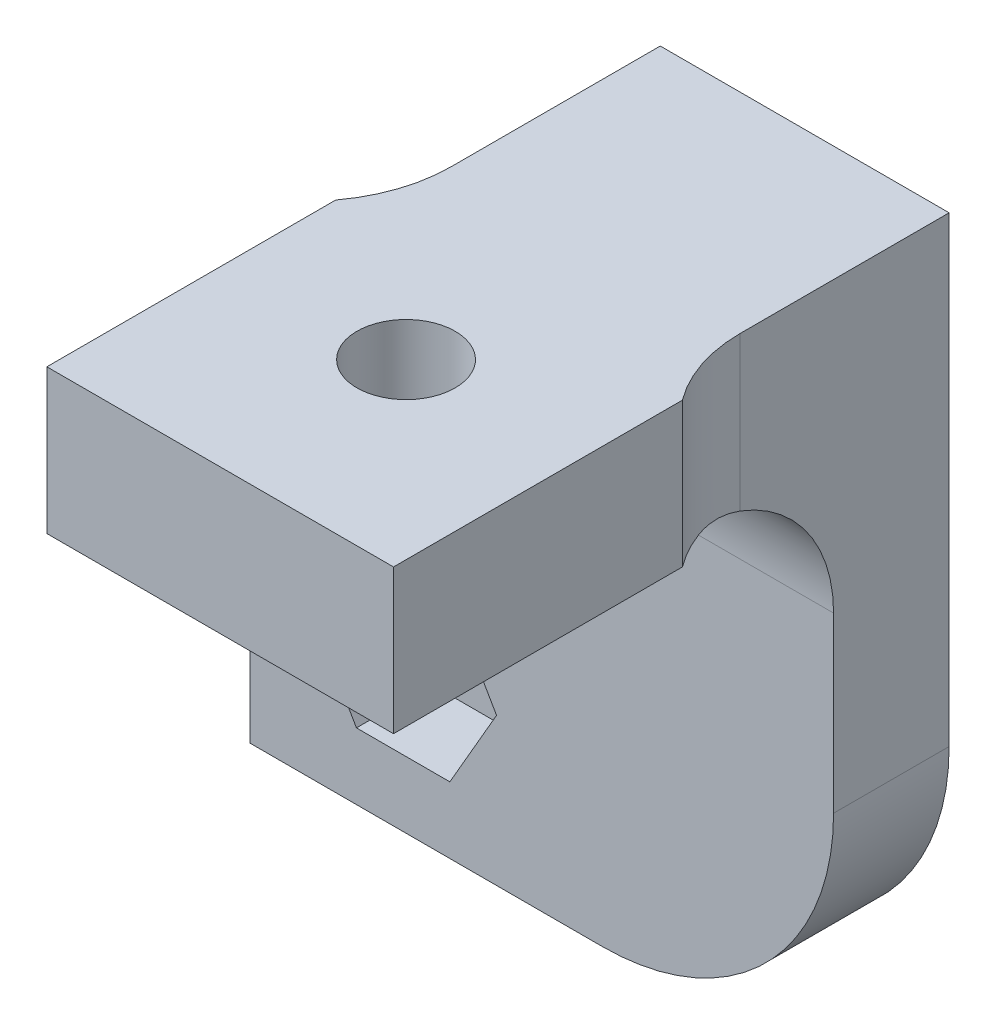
ISO-10303-21;
HEADER;
FILE_DESCRIPTION(('STEP AP214'),'2;1');
FILE_NAME('part.step','',(''),(''),'','','');
FILE_SCHEMA(('AUTOMOTIVE_DESIGN { 1 0 10303 214 1 1 1 1 }'));
ENDSEC;
DATA;
#1=APPLICATION_CONTEXT('core data for automotive mechanical design processes');
#2=APPLICATION_PROTOCOL_DEFINITION('international standard','automotive_design',2000,#1);
#3=PRODUCT_CONTEXT('',#1,'mechanical');
#4=PRODUCT('Part','Part','',(#3));
#5=PRODUCT_RELATED_PRODUCT_CATEGORY('part','',(#4));
#6=PRODUCT_DEFINITION_FORMATION('','',#4);
#7=PRODUCT_DEFINITION_CONTEXT('part definition',#1,'design');
#8=PRODUCT_DEFINITION('design','',#6,#7);
#9=PRODUCT_DEFINITION_SHAPE('','',#8);
#10=(LENGTH_UNIT() NAMED_UNIT(*) SI_UNIT(.MILLI.,.METRE.));
#11=(NAMED_UNIT(*) PLANE_ANGLE_UNIT() SI_UNIT($,.RADIAN.));
#12=(NAMED_UNIT(*) SI_UNIT($,.STERADIAN.) SOLID_ANGLE_UNIT());
#13=UNCERTAINTY_MEASURE_WITH_UNIT(LENGTH_MEASURE(1.E-05),#10,'distance_accuracy_value','');
#14=(GEOMETRIC_REPRESENTATION_CONTEXT(3) GLOBAL_UNCERTAINTY_ASSIGNED_CONTEXT((#13)) GLOBAL_UNIT_ASSIGNED_CONTEXT((#10,
#11,#12)) REPRESENTATION_CONTEXT('',''));
#15=CARTESIAN_POINT('',(0.,0.,0.));
#16=DIRECTION('',(0.,0.,1.));
#17=DIRECTION('',(1.,0.,0.));
#18=AXIS2_PLACEMENT_3D('',#15,#16,#17);
#19=CARTESIAN_POINT('',(-16.3814814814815,-12.6654320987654,4.));
#20=DIRECTION('',(0.,0.,-1.));
#21=DIRECTION('',(-1.,0.,0.));
#22=AXIS2_PLACEMENT_3D('',#19,#20,#21);
#23=CYLINDRICAL_SURFACE('',#22,1.7);
#24=CARTESIAN_POINT('',(-16.3814814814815,-12.6654320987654,0.));
#25=DIRECTION('',(0.,0.,1.));
#26=DIRECTION('',(1.,0.,0.));
#27=AXIS2_PLACEMENT_3D('',#24,#25,#26);
#28=CIRCLE('',#27,1.7);
#29=CARTESIAN_POINT('',(-14.6814814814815,-12.6654320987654,0.));
#30=VERTEX_POINT('',#29);
#31=EDGE_CURVE('E474',#30,#30,#28,.T.);
#32=ORIENTED_EDGE('',*,*,#31,.F.);
#33=EDGE_LOOP('',(#32));
#34=FACE_BOUND('',#33,.T.);
#35=CARTESIAN_POINT('',(-16.3814814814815,-12.6654320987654,1.4));
#36=DIRECTION('',(0.,0.,1.));
#37=DIRECTION('',(1.,0.,0.));
#38=AXIS2_PLACEMENT_3D('',#35,#36,#37);
#39=CIRCLE('',#38,1.7);
#40=CARTESIAN_POINT('',(-14.6814814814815,-12.6654320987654,1.4));
#41=VERTEX_POINT('',#40);
#42=EDGE_CURVE('E463',#41,#41,#39,.T.);
#43=ORIENTED_EDGE('',*,*,#42,.T.);
#44=EDGE_LOOP('',(#43));
#45=FACE_BOUND('',#44,.T.);
#46=ADVANCED_FACE('F33',(#34,#45),#23,.F.);
#47=CARTESIAN_POINT('',(-11.4814814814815,6.23456790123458,4.));
#48=DIRECTION('',(1.,0.,0.));
#49=DIRECTION('',(0.,1.,0.));
#50=AXIS2_PLACEMENT_3D('',#47,#48,#49);
#51=PLANE('',#50);
#52=CARTESIAN_POINT('',(-11.4814814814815,-3.76543209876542,9.));
#53=DIRECTION('',(1.,0.,0.));
#54=DIRECTION('',(0.,1.,0.));
#55=AXIS2_PLACEMENT_3D('',#52,#53,#54);
#56=CIRCLE('',#55,5.);
#57=CARTESIAN_POINT('',(-11.4814814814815,-3.56543209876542,4.00400160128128));
#58=VERTEX_POINT('',#57);
#59=CARTESIAN_POINT('',(-11.4814814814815,0.91199045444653,7.23316150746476));
#60=VERTEX_POINT('',#59);
#61=EDGE_CURVE('E401',#58,#60,#56,.T.);
#62=ORIENTED_EDGE('',*,*,#61,.T.);
#63=DIRECTION('',(0.,1.,0.));
#64=VECTOR('',#63,1.);
#65=CARTESIAN_POINT('',(-11.4814814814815,6.23456790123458,7.23316150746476));
#66=LINE('',#65,#64);
#67=CARTESIAN_POINT('',(-11.4814814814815,6.23456790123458,7.23316150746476));
#68=VERTEX_POINT('',#67);
#69=EDGE_CURVE('E280',#60,#68,#66,.T.);
#70=ORIENTED_EDGE('',*,*,#69,.T.);
#71=DIRECTION('',(0.,0.,-1.));
#72=VECTOR('',#71,1.);
#73=CARTESIAN_POINT('',(-11.4814814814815,6.23456790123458,4.));
#74=LINE('',#73,#72);
#75=CARTESIAN_POINT('',(-11.4814814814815,6.23456790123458,0.));
#76=VERTEX_POINT('',#75);
#77=EDGE_CURVE('E398',#68,#76,#74,.T.);
#78=ORIENTED_EDGE('',*,*,#77,.T.);
#79=DIRECTION('',(0.,-1.,0.));
#80=VECTOR('',#79,1.);
#81=CARTESIAN_POINT('',(-11.4814814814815,6.23456790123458,0.));
#82=LINE('',#81,#80);
#83=CARTESIAN_POINT('',(-11.4814814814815,-3.56543209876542,0.));
#84=VERTEX_POINT('',#83);
#85=EDGE_CURVE('E382',#76,#84,#82,.T.);
#86=ORIENTED_EDGE('',*,*,#85,.T.);
#87=DIRECTION('',(0.,0.,-1.));
#88=VECTOR('',#87,1.);
#89=CARTESIAN_POINT('',(-11.4814814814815,-3.56543209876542,4.));
#90=LINE('',#89,#88);
#91=EDGE_CURVE('E564',#84,#58,#90,.F.);
#92=ORIENTED_EDGE('',*,*,#91,.T.);
#93=EDGE_LOOP('',(#62,#70,#78,#86,#92));
#94=FACE_BOUND('',#93,.T.);
#95=ADVANCED_FACE('F262',(#94),#51,.F.);
#96=CARTESIAN_POINT('',(-11.4814814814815,-17.7654320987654,4.));
#97=DIRECTION('',(0.,1.,0.));
#98=DIRECTION('',(0.,0.,1.));
#99=AXIS2_PLACEMENT_3D('',#96,#97,#98);
#100=PLANE('',#99);
#101=DIRECTION('',(1.,0.,0.));
#102=VECTOR('',#101,1.);
#103=CARTESIAN_POINT('',(-11.4814814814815,-17.7654320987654,0.));
#104=LINE('',#103,#102);
#105=CARTESIAN_POINT('',(-21.6814814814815,-17.7654320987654,0.));
#106=VERTEX_POINT('',#105);
#107=CARTESIAN_POINT('',(-9.4814814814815,-17.7654320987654,0.));
#108=VERTEX_POINT('',#107);
#109=EDGE_CURVE('E373',#106,#108,#104,.T.);
#110=ORIENTED_EDGE('',*,*,#109,.T.);
#111=DIRECTION('',(0.,0.,-1.));
#112=VECTOR('',#111,1.);
#113=CARTESIAN_POINT('',(-9.4814814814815,-17.7654320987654,4.));
#114=LINE('',#113,#112);
#115=CARTESIAN_POINT('',(-9.4814814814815,-17.7654320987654,4.));
#116=VERTEX_POINT('',#115);
#117=EDGE_CURVE('E376',#108,#116,#114,.F.);
#118=ORIENTED_EDGE('',*,*,#117,.T.);
#119=DIRECTION('',(1.,0.,0.));
#120=VECTOR('',#119,1.);
#121=CARTESIAN_POINT('',(-11.4814814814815,-17.7654320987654,4.));
#122=LINE('',#121,#120);
#123=CARTESIAN_POINT('',(-21.6814814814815,-17.7654320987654,4.));
#124=VERTEX_POINT('',#123);
#125=EDGE_CURVE('E540',#124,#116,#122,.T.);
#126=ORIENTED_EDGE('',*,*,#125,.F.);
#127=DIRECTION('',(0.,0.,-1.));
#128=VECTOR('',#127,1.);
#129=CARTESIAN_POINT('',(-21.6814814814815,-17.7654320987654,4.));
#130=LINE('',#129,#128);
#131=EDGE_CURVE('E379',#124,#106,#130,.T.);
#132=ORIENTED_EDGE('',*,*,#131,.T.);
#133=EDGE_LOOP('',(#110,#118,#126,#132));
#134=FACE_BOUND('',#133,.T.);
#135=ADVANCED_FACE('F304',(#134),#100,.F.);
#136=CARTESIAN_POINT('',(-1.4814814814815,6.23456790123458,4.));
#137=DIRECTION('',(-1.,0.,0.));
#138=DIRECTION('',(0.,-1.,0.));
#139=AXIS2_PLACEMENT_3D('',#136,#137,#138);
#140=PLANE('',#139);
#141=DIRECTION('',(0.,0.,-1.));
#142=VECTOR('',#141,1.);
#143=CARTESIAN_POINT('',(-1.4814814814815,6.23456790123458,4.));
#144=LINE('',#143,#142);
#145=CARTESIAN_POINT('',(-1.4814814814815,6.23456790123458,7.23316150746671));
#146=VERTEX_POINT('',#145);
#147=CARTESIAN_POINT('',(-1.4814814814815,6.23456790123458,0.));
#148=VERTEX_POINT('',#147);
#149=EDGE_CURVE('E409',#146,#148,#144,.T.);
#150=ORIENTED_EDGE('',*,*,#149,.F.);
#151=DIRECTION('',(0.,-1.,0.));
#152=VECTOR('',#151,1.);
#153=CARTESIAN_POINT('',(-1.4814814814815,6.23456790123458,7.23316150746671));
#154=LINE('',#153,#152);
#155=CARTESIAN_POINT('',(-1.4814814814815,0.911990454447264,7.23316150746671));
#156=VERTEX_POINT('',#155);
#157=EDGE_CURVE('E243',#146,#156,#154,.T.);
#158=ORIENTED_EDGE('',*,*,#157,.T.);
#159=CARTESIAN_POINT('',(-1.4814814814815,-3.76543209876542,9.));
#160=DIRECTION('',(-1.,0.,0.));
#161=DIRECTION('',(0.,-1.,0.));
#162=AXIS2_PLACEMENT_3D('',#159,#160,#161);
#163=CIRCLE('',#162,5.);
#164=CARTESIAN_POINT('',(-1.4814814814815,-3.76543209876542,4.));
#165=VERTEX_POINT('',#164);
#166=EDGE_CURVE('E554',#156,#165,#163,.T.);
#167=ORIENTED_EDGE('',*,*,#166,.T.);
#168=DIRECTION('',(0.,1.,0.));
#169=VECTOR('',#168,1.);
#170=CARTESIAN_POINT('',(-1.4814814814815,6.23456790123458,4.));
#171=LINE('',#170,#169);
#172=CARTESIAN_POINT('',(-1.48148148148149,-9.76543209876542,4.));
#173=VERTEX_POINT('',#172);
#174=EDGE_CURVE('E410',#173,#165,#171,.T.);
#175=ORIENTED_EDGE('',*,*,#174,.F.);
#176=DIRECTION('',(0.,0.,-1.));
#177=VECTOR('',#176,1.);
#178=CARTESIAN_POINT('',(-1.48148148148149,-9.76543209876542,4.));
#179=LINE('',#178,#177);
#180=CARTESIAN_POINT('',(-1.48148148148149,-9.76543209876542,0.));
#181=VERTEX_POINT('',#180);
#182=EDGE_CURVE('E391',#173,#181,#179,.T.);
#183=ORIENTED_EDGE('',*,*,#182,.T.);
#184=DIRECTION('',(0.,1.,0.));
#185=VECTOR('',#184,1.);
#186=CARTESIAN_POINT('',(-1.4814814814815,6.23456790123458,0.));
#187=LINE('',#186,#185);
#188=EDGE_CURVE('E381',#181,#148,#187,.T.);
#189=ORIENTED_EDGE('',*,*,#188,.T.);
#190=EDGE_LOOP('',(#150,#158,#167,#175,#183,#189));
#191=FACE_BOUND('',#190,.T.);
#192=ADVANCED_FACE('F363',(#191),#140,.F.);
#193=CARTESIAN_POINT('',(-11.4814814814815,6.23456790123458,4.));
#194=DIRECTION('',(0.,-1.,0.));
#195=DIRECTION('',(0.,0.,-1.));
#196=AXIS2_PLACEMENT_3D('',#193,#194,#195);
#197=PLANE('',#196);
#198=ORIENTED_EDGE('',*,*,#77,.F.);
#199=CARTESIAN_POINT('',(-16.4814814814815,6.23456790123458,7.23316150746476));
#200=DIRECTION('',(0.,-1.,0.));
#201=DIRECTION('',(0.,0.,-1.));
#202=AXIS2_PLACEMENT_3D('',#199,#200,#201);
#203=CIRCLE('',#202,5.);
#204=CARTESIAN_POINT('',(-12.4814814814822,6.23456790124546,10.2331615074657));
#205=VERTEX_POINT('',#204);
#206=EDGE_CURVE('E11',#68,#205,#203,.T.);
#207=ORIENTED_EDGE('',*,*,#206,.T.);
#208=DIRECTION('',(0.,0.,-1.));
#209=VECTOR('',#208,1.);
#210=CARTESIAN_POINT('',(-12.4814814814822,6.23456790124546,20.2331615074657));
#211=LINE('',#210,#209);
#212=CARTESIAN_POINT('',(-12.4814814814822,6.23456790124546,20.2331615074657));
#213=VERTEX_POINT('',#212);
#214=EDGE_CURVE('E226',#213,#205,#211,.T.);
#215=ORIENTED_EDGE('',*,*,#214,.F.);
#216=DIRECTION('',(-1.,0.,0.));
#217=VECTOR('',#216,1.);
#218=CARTESIAN_POINT('',(-0.481481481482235,6.23456790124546,20.2331615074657));
#219=LINE('',#218,#217);
#220=CARTESIAN_POINT('',(-0.481481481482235,6.23456790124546,20.2331615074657));
#221=VERTEX_POINT('',#220);
#222=EDGE_CURVE('E237',#221,#213,#219,.T.);
#223=ORIENTED_EDGE('',*,*,#222,.F.);
#224=DIRECTION('',(0.,0.,1.));
#225=VECTOR('',#224,1.);
#226=CARTESIAN_POINT('',(-0.481481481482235,6.23456790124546,10.2331615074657));
#227=LINE('',#226,#225);
#228=CARTESIAN_POINT('',(-0.481481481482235,6.23456790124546,10.2331615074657));
#229=VERTEX_POINT('',#228);
#230=EDGE_CURVE('E219',#229,#221,#227,.T.);
#231=ORIENTED_EDGE('',*,*,#230,.F.);
#232=CARTESIAN_POINT('',(3.5185185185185,6.23456790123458,7.23316150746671));
#233=DIRECTION('',(0.,-1.,0.));
#234=DIRECTION('',(0.,0.,-1.));
#235=AXIS2_PLACEMENT_3D('',#232,#233,#234);
#236=CIRCLE('',#235,5.);
#237=EDGE_CURVE('E233',#229,#146,#236,.T.);
#238=ORIENTED_EDGE('',*,*,#237,.T.);
#239=ORIENTED_EDGE('',*,*,#149,.T.);
#240=DIRECTION('',(-1.,0.,0.));
#241=VECTOR('',#240,1.);
#242=CARTESIAN_POINT('',(-11.4814814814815,6.23456790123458,0.));
#243=LINE('',#242,#241);
#244=EDGE_CURVE('E407',#148,#76,#243,.T.);
#245=ORIENTED_EDGE('',*,*,#244,.T.);
#246=EDGE_LOOP('',(#198,#207,#215,#223,#231,#238,#239,#245));
#247=FACE_BOUND('',#246,.T.);
#248=CARTESIAN_POINT('',(-6.4814814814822,6.23456790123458,13.8000000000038));
#249=DIRECTION('',(0.,-1.,0.));
#250=DIRECTION('',(0.,0.,-1.));
#251=AXIS2_PLACEMENT_3D('',#248,#249,#250);
#252=CIRCLE('',#251,1.70000000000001);
#253=CARTESIAN_POINT('',(-6.4814814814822,6.23456790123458,12.1000000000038));
#254=VERTEX_POINT('',#253);
#255=EDGE_CURVE('E489',#254,#254,#252,.T.);
#256=ORIENTED_EDGE('',*,*,#255,.T.);
#257=EDGE_LOOP('',(#256));
#258=FACE_BOUND('',#257,.T.);
#259=ADVANCED_FACE('F231',(#247,#258),#197,.F.);
#260=CARTESIAN_POINT('',(0.,0.,4.));
#261=DIRECTION('',(0.,0.,1.));
#262=DIRECTION('',(1.,0.,0.));
#263=AXIS2_PLACEMENT_3D('',#260,#261,#262);
#264=PLANE('',#263);
#265=DIRECTION('',(-0.5,0.866025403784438,0.));
#266=VECTOR('',#265,1.);
#267=CARTESIAN_POINT('',(-13.148319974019,-12.6654320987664,4.));
#268=LINE('',#267,#266);
#269=CARTESIAN_POINT('',(-13.148319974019,-12.6654320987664,4.));
#270=VERTEX_POINT('',#269);
#271=CARTESIAN_POINT('',(-14.7649007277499,-9.86543209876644,4.));
#272=VERTEX_POINT('',#271);
#273=EDGE_CURVE('E418',#270,#272,#268,.T.);
#274=ORIENTED_EDGE('',*,*,#273,.F.);
#275=DIRECTION('',(0.499999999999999,0.866025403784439,0.));
#276=VECTOR('',#275,1.);
#277=CARTESIAN_POINT('',(-14.7649007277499,-15.4654320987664,4.));
#278=LINE('',#277,#276);
#279=CARTESIAN_POINT('',(-14.7649007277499,-15.4654320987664,4.));
#280=VERTEX_POINT('',#279);
#281=EDGE_CURVE('E432',#280,#270,#278,.T.);
#282=ORIENTED_EDGE('',*,*,#281,.F.);
#283=DIRECTION('',(1.,0.,0.));
#284=VECTOR('',#283,1.);
#285=CARTESIAN_POINT('',(-17.9980622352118,-15.4654320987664,4.));
#286=LINE('',#285,#284);
#287=CARTESIAN_POINT('',(-17.9980622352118,-15.4654320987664,4.));
#288=VERTEX_POINT('',#287);
#289=EDGE_CURVE('E456',#288,#280,#286,.T.);
#290=ORIENTED_EDGE('',*,*,#289,.F.);
#291=DIRECTION('',(0.500000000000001,-0.866025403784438,0.));
#292=VECTOR('',#291,1.);
#293=CARTESIAN_POINT('',(-19.6146429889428,-12.6654320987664,4.));
#294=LINE('',#293,#292);
#295=CARTESIAN_POINT('',(-19.6146429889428,-12.6654320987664,4.));
#296=VERTEX_POINT('',#295);
#297=EDGE_CURVE('E453',#296,#288,#294,.T.);
#298=ORIENTED_EDGE('',*,*,#297,.F.);
#299=DIRECTION('',(-0.499999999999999,-0.866025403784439,0.));
#300=VECTOR('',#299,1.);
#301=CARTESIAN_POINT('',(-17.9980622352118,-9.86543209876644,4.));
#302=LINE('',#301,#300);
#303=CARTESIAN_POINT('',(-17.9980622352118,-9.86543209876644,4.));
#304=VERTEX_POINT('',#303);
#305=EDGE_CURVE('E450',#304,#296,#302,.T.);
#306=ORIENTED_EDGE('',*,*,#305,.F.);
#307=DIRECTION('',(-1.,0.,0.));
#308=VECTOR('',#307,1.);
#309=CARTESIAN_POINT('',(-14.7649007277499,-9.86543209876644,4.));
#310=LINE('',#309,#308);
#311=EDGE_CURVE('E421',#272,#304,#310,.T.);
#312=ORIENTED_EDGE('',*,*,#311,.F.);
#313=EDGE_LOOP('',(#274,#282,#290,#298,#306,#312));
#314=FACE_BOUND('',#313,.T.);
#315=ORIENTED_EDGE('',*,*,#125,.T.);
#316=CARTESIAN_POINT('',(-9.4814814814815,-9.76543209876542,4.));
#317=DIRECTION('',(0.,0.,1.));
#318=DIRECTION('',(1.,0.,0.));
#319=AXIS2_PLACEMENT_3D('',#316,#317,#318);
#320=CIRCLE('',#319,8.);
#321=EDGE_CURVE('E388',#116,#173,#320,.T.);
#322=ORIENTED_EDGE('',*,*,#321,.T.);
#323=ORIENTED_EDGE('',*,*,#174,.T.);
#324=DIRECTION('',(1.,0.,0.));
#325=VECTOR('',#324,1.);
#326=CARTESIAN_POINT('',(0.,-3.76543209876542,4.));
#327=LINE('',#326,#325);
#328=CARTESIAN_POINT('',(-11.4864846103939,-3.76543209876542,4.));
#329=VERTEX_POINT('',#328);
#330=EDGE_CURVE('E552',#165,#329,#327,.F.);
#331=ORIENTED_EDGE('',*,*,#330,.T.);
#332=CARTESIAN_POINT('',(-15.4814814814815,-3.56543209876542,4.));
#333=DIRECTION('',(0.,0.,1.));
#334=DIRECTION('',(1.,0.,0.));
#335=AXIS2_PLACEMENT_3D('',#332,#333,#334);
#336=CIRCLE('',#335,4.);
#337=CARTESIAN_POINT('',(-15.4814814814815,-7.56543209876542,4.));
#338=VERTEX_POINT('',#337);
#339=EDGE_CURVE('E575',#329,#338,#336,.F.);
#340=ORIENTED_EDGE('',*,*,#339,.T.);
#341=DIRECTION('',(-1.,0.,0.));
#342=VECTOR('',#341,1.);
#343=CARTESIAN_POINT('',(-11.4814814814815,-7.56543209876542,4.));
#344=LINE('',#343,#342);
#345=CARTESIAN_POINT('',(-17.6814814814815,-7.56543209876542,4.));
#346=VERTEX_POINT('',#345);
#347=EDGE_CURVE('E478',#338,#346,#344,.T.);
#348=ORIENTED_EDGE('',*,*,#347,.T.);
#349=CARTESIAN_POINT('',(-17.6814814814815,-11.5654320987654,4.));
#350=DIRECTION('',(0.,0.,1.));
#351=DIRECTION('',(1.,0.,0.));
#352=AXIS2_PLACEMENT_3D('',#349,#350,#351);
#353=CIRCLE('',#352,4.);
#354=CARTESIAN_POINT('',(-21.6814814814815,-11.5654320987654,4.));
#355=VERTEX_POINT('',#354);
#356=EDGE_CURVE('E571',#346,#355,#353,.T.);
#357=ORIENTED_EDGE('',*,*,#356,.T.);
#358=DIRECTION('',(0.,-1.,0.));
#359=VECTOR('',#358,1.);
#360=CARTESIAN_POINT('',(-21.6814814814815,-17.7654320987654,4.));
#361=LINE('',#360,#359);
#362=EDGE_CURVE('E481',#355,#124,#361,.T.);
#363=ORIENTED_EDGE('',*,*,#362,.T.);
#364=EDGE_LOOP('',(#315,#322,#323,#331,#340,#348,#357,#363));
#365=FACE_BOUND('',#364,.T.);
#366=ADVANCED_FACE('F354',(#314,#365),#264,.T.);
#367=CARTESIAN_POINT('',(0.,0.,0.));
#368=DIRECTION('',(0.,0.,1.));
#369=DIRECTION('',(1.,0.,0.));
#370=AXIS2_PLACEMENT_3D('',#367,#368,#369);
#371=PLANE('',#370);
#372=ORIENTED_EDGE('',*,*,#188,.F.);
#373=CARTESIAN_POINT('',(-9.4814814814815,-9.76543209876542,0.));
#374=DIRECTION('',(0.,0.,1.));
#375=DIRECTION('',(1.,0.,0.));
#376=AXIS2_PLACEMENT_3D('',#373,#374,#375);
#377=CIRCLE('',#376,8.);
#378=EDGE_CURVE('E386',#181,#108,#377,.F.);
#379=ORIENTED_EDGE('',*,*,#378,.T.);
#380=ORIENTED_EDGE('',*,*,#109,.F.);
#381=DIRECTION('',(0.,-1.,0.));
#382=VECTOR('',#381,1.);
#383=CARTESIAN_POINT('',(-21.6814814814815,-17.7654320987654,0.));
#384=LINE('',#383,#382);
#385=CARTESIAN_POINT('',(-21.6814814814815,-11.5654320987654,0.));
#386=VERTEX_POINT('',#385);
#387=EDGE_CURVE('E482',#386,#106,#384,.T.);
#388=ORIENTED_EDGE('',*,*,#387,.F.);
#389=CARTESIAN_POINT('',(-17.6814814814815,-11.5654320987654,0.));
#390=DIRECTION('',(0.,0.,1.));
#391=DIRECTION('',(1.,0.,0.));
#392=AXIS2_PLACEMENT_3D('',#389,#390,#391);
#393=CIRCLE('',#392,4.);
#394=CARTESIAN_POINT('',(-17.6814814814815,-7.56543209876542,0.));
#395=VERTEX_POINT('',#394);
#396=EDGE_CURVE('E569',#386,#395,#393,.F.);
#397=ORIENTED_EDGE('',*,*,#396,.T.);
#398=DIRECTION('',(-1.,0.,0.));
#399=VECTOR('',#398,1.);
#400=CARTESIAN_POINT('',(-11.4814814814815,-7.56543209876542,0.));
#401=LINE('',#400,#399);
#402=CARTESIAN_POINT('',(-15.4814814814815,-7.56543209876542,0.));
#403=VERTEX_POINT('',#402);
#404=EDGE_CURVE('E477',#403,#395,#401,.T.);
#405=ORIENTED_EDGE('',*,*,#404,.F.);
#406=CARTESIAN_POINT('',(-15.4814814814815,-3.56543209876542,0.));
#407=DIRECTION('',(0.,0.,1.));
#408=DIRECTION('',(1.,0.,0.));
#409=AXIS2_PLACEMENT_3D('',#406,#407,#408);
#410=CIRCLE('',#409,4.);
#411=EDGE_CURVE('E572',#403,#84,#410,.T.);
#412=ORIENTED_EDGE('',*,*,#411,.T.);
#413=ORIENTED_EDGE('',*,*,#85,.F.);
#414=ORIENTED_EDGE('',*,*,#244,.F.);
#415=EDGE_LOOP('',(#372,#379,#380,#388,#397,#405,#412,#413,#414));
#416=FACE_BOUND('',#415,.T.);
#417=ORIENTED_EDGE('',*,*,#31,.T.);
#418=EDGE_LOOP('',(#417));
#419=FACE_BOUND('',#418,.T.);
#420=ADVANCED_FACE('F353',(#416,#419),#371,.F.);
#421=CARTESIAN_POINT('',(-11.4814814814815,1.23456790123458,19.4));
#422=DIRECTION('',(0.,1.,0.));
#423=DIRECTION('',(0.,0.,1.));
#424=AXIS2_PLACEMENT_3D('',#421,#422,#423);
#425=PLANE('',#424);
#426=DIRECTION('',(0.,0.,-1.));
#427=VECTOR('',#426,1.);
#428=CARTESIAN_POINT('',(-12.4814814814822,1.23456790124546,20.2331615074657));
#429=LINE('',#428,#427);
#430=CARTESIAN_POINT('',(-12.4814814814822,1.23456790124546,20.2331615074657));
#431=VERTEX_POINT('',#430);
#432=CARTESIAN_POINT('',(-12.4814814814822,1.23456790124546,10.2331615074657));
#433=VERTEX_POINT('',#432);
#434=EDGE_CURVE('E238',#431,#433,#429,.T.);
#435=ORIENTED_EDGE('',*,*,#434,.T.);
#436=CARTESIAN_POINT('',(-16.4814814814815,1.23456790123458,7.23316150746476));
#437=DIRECTION('',(0.,1.,0.));
#438=DIRECTION('',(0.,0.,1.));
#439=AXIS2_PLACEMENT_3D('',#436,#437,#438);
#440=CIRCLE('',#439,5.);
#441=CARTESIAN_POINT('',(-11.8040589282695,1.23456790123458,9.));
#442=VERTEX_POINT('',#441);
#443=EDGE_CURVE('E244',#433,#442,#440,.T.);
#444=ORIENTED_EDGE('',*,*,#443,.T.);
#445=DIRECTION('',(1.,0.,0.));
#446=VECTOR('',#445,1.);
#447=CARTESIAN_POINT('',(-11.4814814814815,1.23456790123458,9.));
#448=LINE('',#447,#446);
#449=CARTESIAN_POINT('',(-1.15890403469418,1.23456790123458,9.));
#450=VERTEX_POINT('',#449);
#451=EDGE_CURVE('E49',#442,#450,#448,.T.);
#452=ORIENTED_EDGE('',*,*,#451,.T.);
#453=CARTESIAN_POINT('',(3.5185185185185,1.23456790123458,7.23316150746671));
#454=DIRECTION('',(0.,1.,0.));
#455=DIRECTION('',(0.,0.,1.));
#456=AXIS2_PLACEMENT_3D('',#453,#454,#455);
#457=CIRCLE('',#456,5.);
#458=CARTESIAN_POINT('',(-0.481481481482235,1.23456790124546,10.2331615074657));
#459=VERTEX_POINT('',#458);
#460=EDGE_CURVE('E245',#450,#459,#457,.T.);
#461=ORIENTED_EDGE('',*,*,#460,.T.);
#462=DIRECTION('',(0.,0.,1.));
#463=VECTOR('',#462,1.);
#464=CARTESIAN_POINT('',(-0.481481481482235,1.23456790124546,10.2331615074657));
#465=LINE('',#464,#463);
#466=CARTESIAN_POINT('',(-0.481481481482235,1.23456790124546,20.2331615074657));
#467=VERTEX_POINT('',#466);
#468=EDGE_CURVE('E221',#459,#467,#465,.T.);
#469=ORIENTED_EDGE('',*,*,#468,.T.);
#470=DIRECTION('',(-1.,0.,0.));
#471=VECTOR('',#470,1.);
#472=CARTESIAN_POINT('',(-0.481481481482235,1.23456790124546,20.2331615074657));
#473=LINE('',#472,#471);
#474=EDGE_CURVE('E592',#467,#431,#473,.T.);
#475=ORIENTED_EDGE('',*,*,#474,.T.);
#476=EDGE_LOOP('',(#435,#444,#452,#461,#469,#475));
#477=FACE_BOUND('',#476,.T.);
#478=DIRECTION('',(0.866025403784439,0.,0.5));
#479=VECTOR('',#478,1.);
#480=CARTESIAN_POINT('',(-6.48148148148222,1.23456790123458,10.5668384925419));
#481=LINE('',#480,#479);
#482=CARTESIAN_POINT('',(-6.48148148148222,1.23456790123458,10.5668384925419));
#483=VERTEX_POINT('',#482);
#484=CARTESIAN_POINT('',(-3.68148148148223,1.23456790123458,12.1834192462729));
#485=VERTEX_POINT('',#484);
#486=EDGE_CURVE('E514',#483,#485,#481,.T.);
#487=ORIENTED_EDGE('',*,*,#486,.F.);
#488=DIRECTION('',(0.866025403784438,0.,-0.5));
#489=VECTOR('',#488,1.);
#490=CARTESIAN_POINT('',(-9.28148148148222,1.23456790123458,12.1834192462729));
#491=LINE('',#490,#489);
#492=CARTESIAN_POINT('',(-9.28148148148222,1.23456790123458,12.1834192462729));
#493=VERTEX_POINT('',#492);
#494=EDGE_CURVE('E492',#493,#483,#491,.T.);
#495=ORIENTED_EDGE('',*,*,#494,.F.);
#496=DIRECTION('',(0.,0.,-1.));
#497=VECTOR('',#496,1.);
#498=CARTESIAN_POINT('',(-9.28148148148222,1.23456790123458,15.4165807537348));
#499=LINE('',#498,#497);
#500=CARTESIAN_POINT('',(-9.28148148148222,1.23456790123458,15.4165807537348));
#501=VERTEX_POINT('',#500);
#502=EDGE_CURVE('E497',#501,#493,#499,.T.);
#503=ORIENTED_EDGE('',*,*,#502,.F.);
#504=DIRECTION('',(-0.866025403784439,0.,-0.5));
#505=VECTOR('',#504,1.);
#506=CARTESIAN_POINT('',(-6.48148148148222,1.23456790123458,17.0331615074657));
#507=LINE('',#506,#505);
#508=CARTESIAN_POINT('',(-6.48148148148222,1.23456790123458,17.0331615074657));
#509=VERTEX_POINT('',#508);
#510=EDGE_CURVE('E523',#509,#501,#507,.T.);
#511=ORIENTED_EDGE('',*,*,#510,.F.);
#512=DIRECTION('',(-0.866025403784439,0.,0.499999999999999));
#513=VECTOR('',#512,1.);
#514=CARTESIAN_POINT('',(-3.68148148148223,1.23456790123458,15.4165807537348));
#515=LINE('',#514,#513);
#516=CARTESIAN_POINT('',(-3.68148148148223,1.23456790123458,15.4165807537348));
#517=VERTEX_POINT('',#516);
#518=EDGE_CURVE('E520',#517,#509,#515,.T.);
#519=ORIENTED_EDGE('',*,*,#518,.F.);
#520=DIRECTION('',(0.,0.,1.));
#521=VECTOR('',#520,1.);
#522=CARTESIAN_POINT('',(-3.68148148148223,1.23456790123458,12.1834192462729));
#523=LINE('',#522,#521);
#524=EDGE_CURVE('E517',#485,#517,#523,.T.);
#525=ORIENTED_EDGE('',*,*,#524,.F.);
#526=EDGE_LOOP('',(#487,#495,#503,#511,#519,#525));
#527=FACE_BOUND('',#526,.T.);
#528=ADVANCED_FACE('F349',(#477,#527),#425,.F.);
#529=CARTESIAN_POINT('',(-9.28148148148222,3.83456790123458,12.1834192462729));
#530=DIRECTION('',(-0.5,0.,-0.866025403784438));
#531=DIRECTION('',(-0.866025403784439,0.,0.5));
#532=AXIS2_PLACEMENT_3D('',#529,#530,#531);
#533=PLANE('',#532);
#534=ORIENTED_EDGE('',*,*,#494,.T.);
#535=DIRECTION('',(0.,-1.,0.));
#536=VECTOR('',#535,1.);
#537=CARTESIAN_POINT('',(-6.48148148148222,3.83456790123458,10.5668384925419));
#538=LINE('',#537,#536);
#539=CARTESIAN_POINT('',(-6.48148148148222,3.83456790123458,10.5668384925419));
#540=VERTEX_POINT('',#539);
#541=EDGE_CURVE('E512',#540,#483,#538,.T.);
#542=ORIENTED_EDGE('',*,*,#541,.F.);
#543=DIRECTION('',(0.866025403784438,0.,-0.5));
#544=VECTOR('',#543,1.);
#545=CARTESIAN_POINT('',(-9.28148148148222,3.83456790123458,12.1834192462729));
#546=LINE('',#545,#544);
#547=CARTESIAN_POINT('',(-9.28148148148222,3.83456790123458,12.1834192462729));
#548=VERTEX_POINT('',#547);
#549=EDGE_CURVE('E493',#548,#540,#546,.T.);
#550=ORIENTED_EDGE('',*,*,#549,.F.);
#551=DIRECTION('',(0.,-1.,0.));
#552=VECTOR('',#551,1.);
#553=CARTESIAN_POINT('',(-9.28148148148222,3.83456790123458,12.1834192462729));
#554=LINE('',#553,#552);
#555=EDGE_CURVE('E528',#548,#493,#554,.T.);
#556=ORIENTED_EDGE('',*,*,#555,.T.);
#557=EDGE_LOOP('',(#534,#542,#550,#556));
#558=FACE_BOUND('',#557,.T.);
#559=ADVANCED_FACE('F331',(#558),#533,.F.);
#560=CARTESIAN_POINT('',(-9.28148148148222,3.83456790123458,15.4165807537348));
#561=DIRECTION('',(-1.,0.,0.));
#562=DIRECTION('',(0.,0.,1.));
#563=AXIS2_PLACEMENT_3D('',#560,#561,#562);
#564=PLANE('',#563);
#565=ORIENTED_EDGE('',*,*,#502,.T.);
#566=ORIENTED_EDGE('',*,*,#555,.F.);
#567=DIRECTION('',(0.,0.,-1.));
#568=VECTOR('',#567,1.);
#569=CARTESIAN_POINT('',(-9.28148148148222,3.83456790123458,15.4165807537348));
#570=LINE('',#569,#568);
#571=CARTESIAN_POINT('',(-9.28148148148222,3.83456790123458,15.4165807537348));
#572=VERTEX_POINT('',#571);
#573=EDGE_CURVE('E509',#572,#548,#570,.T.);
#574=ORIENTED_EDGE('',*,*,#573,.F.);
#575=DIRECTION('',(0.,-1.,0.));
#576=VECTOR('',#575,1.);
#577=CARTESIAN_POINT('',(-9.28148148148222,3.83456790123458,15.4165807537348));
#578=LINE('',#577,#576);
#579=EDGE_CURVE('E530',#572,#501,#578,.T.);
#580=ORIENTED_EDGE('',*,*,#579,.T.);
#581=EDGE_LOOP('',(#565,#566,#574,#580));
#582=FACE_BOUND('',#581,.T.);
#583=ADVANCED_FACE('F327',(#582),#564,.F.);
#584=CARTESIAN_POINT('',(-6.48148148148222,3.83456790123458,17.0331615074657));
#585=DIRECTION('',(-0.499999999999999,0.,0.866025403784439));
#586=DIRECTION('',(0.866025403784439,0.,0.499999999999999));
#587=AXIS2_PLACEMENT_3D('',#584,#585,#586);
#588=PLANE('',#587);
#589=ORIENTED_EDGE('',*,*,#510,.T.);
#590=ORIENTED_EDGE('',*,*,#579,.F.);
#591=DIRECTION('',(-0.866025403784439,0.,-0.5));
#592=VECTOR('',#591,1.);
#593=CARTESIAN_POINT('',(-6.48148148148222,3.83456790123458,17.0331615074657));
#594=LINE('',#593,#592);
#595=CARTESIAN_POINT('',(-6.48148148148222,3.83456790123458,17.0331615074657));
#596=VERTEX_POINT('',#595);
#597=EDGE_CURVE('E506',#596,#572,#594,.T.);
#598=ORIENTED_EDGE('',*,*,#597,.F.);
#599=DIRECTION('',(0.,-1.,0.));
#600=VECTOR('',#599,1.);
#601=CARTESIAN_POINT('',(-6.48148148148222,3.83456790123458,17.0331615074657));
#602=LINE('',#601,#600);
#603=EDGE_CURVE('E532',#596,#509,#602,.T.);
#604=ORIENTED_EDGE('',*,*,#603,.T.);
#605=EDGE_LOOP('',(#589,#590,#598,#604));
#606=FACE_BOUND('',#605,.T.);
#607=ADVANCED_FACE('F330',(#606),#588,.F.);
#608=CARTESIAN_POINT('',(-3.68148148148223,3.83456790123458,15.4165807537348));
#609=DIRECTION('',(0.499999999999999,0.,0.866025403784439));
#610=DIRECTION('',(0.866025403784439,0.,-0.499999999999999));
#611=AXIS2_PLACEMENT_3D('',#608,#609,#610);
#612=PLANE('',#611);
#613=ORIENTED_EDGE('',*,*,#518,.T.);
#614=ORIENTED_EDGE('',*,*,#603,.F.);
#615=DIRECTION('',(-0.866025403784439,0.,0.499999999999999));
#616=VECTOR('',#615,1.);
#617=CARTESIAN_POINT('',(-3.68148148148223,3.83456790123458,15.4165807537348));
#618=LINE('',#617,#616);
#619=CARTESIAN_POINT('',(-3.68148148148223,3.83456790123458,15.4165807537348));
#620=VERTEX_POINT('',#619);
#621=EDGE_CURVE('E503',#620,#596,#618,.T.);
#622=ORIENTED_EDGE('',*,*,#621,.F.);
#623=DIRECTION('',(0.,-1.,0.));
#624=VECTOR('',#623,1.);
#625=CARTESIAN_POINT('',(-3.68148148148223,3.83456790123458,15.4165807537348));
#626=LINE('',#625,#624);
#627=EDGE_CURVE('E534',#620,#517,#626,.T.);
#628=ORIENTED_EDGE('',*,*,#627,.T.);
#629=EDGE_LOOP('',(#613,#614,#622,#628));
#630=FACE_BOUND('',#629,.T.);
#631=ADVANCED_FACE('F335',(#630),#612,.F.);
#632=CARTESIAN_POINT('',(-3.68148148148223,3.83456790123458,12.1834192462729));
#633=DIRECTION('',(1.,0.,0.));
#634=DIRECTION('',(0.,0.,-1.));
#635=AXIS2_PLACEMENT_3D('',#632,#633,#634);
#636=PLANE('',#635);
#637=ORIENTED_EDGE('',*,*,#524,.T.);
#638=ORIENTED_EDGE('',*,*,#627,.F.);
#639=DIRECTION('',(0.,0.,1.));
#640=VECTOR('',#639,1.);
#641=CARTESIAN_POINT('',(-3.68148148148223,3.83456790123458,12.1834192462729));
#642=LINE('',#641,#640);
#643=CARTESIAN_POINT('',(-3.68148148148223,3.83456790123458,12.1834192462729));
#644=VERTEX_POINT('',#643);
#645=EDGE_CURVE('E500',#644,#620,#642,.T.);
#646=ORIENTED_EDGE('',*,*,#645,.F.);
#647=DIRECTION('',(0.,-1.,0.));
#648=VECTOR('',#647,1.);
#649=CARTESIAN_POINT('',(-3.68148148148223,3.83456790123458,12.1834192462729));
#650=LINE('',#649,#648);
#651=EDGE_CURVE('E536',#644,#485,#650,.T.);
#652=ORIENTED_EDGE('',*,*,#651,.T.);
#653=EDGE_LOOP('',(#637,#638,#646,#652));
#654=FACE_BOUND('',#653,.T.);
#655=ADVANCED_FACE('F339',(#654),#636,.F.);
#656=CARTESIAN_POINT('',(-6.48148148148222,3.83456790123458,10.5668384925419));
#657=DIRECTION('',(0.5,0.,-0.866025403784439));
#658=DIRECTION('',(-0.866025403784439,0.,-0.5));
#659=AXIS2_PLACEMENT_3D('',#656,#657,#658);
#660=PLANE('',#659);
#661=ORIENTED_EDGE('',*,*,#486,.T.);
#662=ORIENTED_EDGE('',*,*,#651,.F.);
#663=DIRECTION('',(0.866025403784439,0.,0.5));
#664=VECTOR('',#663,1.);
#665=CARTESIAN_POINT('',(-6.48148148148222,3.83456790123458,10.5668384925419));
#666=LINE('',#665,#664);
#667=EDGE_CURVE('E496',#540,#644,#666,.T.);
#668=ORIENTED_EDGE('',*,*,#667,.F.);
#669=ORIENTED_EDGE('',*,*,#541,.T.);
#670=EDGE_LOOP('',(#661,#662,#668,#669));
#671=FACE_BOUND('',#670,.T.);
#672=ADVANCED_FACE('F325',(#671),#660,.F.);
#673=CARTESIAN_POINT('',(0.,3.83456790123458,0.));
#674=DIRECTION('',(0.,-1.,0.));
#675=DIRECTION('',(0.,0.,-1.));
#676=AXIS2_PLACEMENT_3D('',#673,#674,#675);
#677=PLANE('',#676);
#678=CARTESIAN_POINT('',(-6.4814814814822,3.83456790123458,13.8000000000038));
#679=DIRECTION('',(0.,-1.,0.));
#680=DIRECTION('',(0.,0.,-1.));
#681=AXIS2_PLACEMENT_3D('',#678,#679,#680);
#682=CIRCLE('',#681,1.70000000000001);
#683=CARTESIAN_POINT('',(-6.4814814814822,3.83456790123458,12.1000000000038));
#684=VERTEX_POINT('',#683);
#685=EDGE_CURVE('E488',#684,#684,#682,.T.);
#686=ORIENTED_EDGE('',*,*,#685,.F.);
#687=EDGE_LOOP('',(#686));
#688=FACE_BOUND('',#687,.T.);
#689=ORIENTED_EDGE('',*,*,#549,.T.);
#690=ORIENTED_EDGE('',*,*,#667,.T.);
#691=ORIENTED_EDGE('',*,*,#645,.T.);
#692=ORIENTED_EDGE('',*,*,#621,.T.);
#693=ORIENTED_EDGE('',*,*,#597,.T.);
#694=ORIENTED_EDGE('',*,*,#573,.T.);
#695=EDGE_LOOP('',(#689,#690,#691,#692,#693,#694));
#696=FACE_BOUND('',#695,.T.);
#697=ADVANCED_FACE('F321',(#688,#696),#677,.T.);
#698=CARTESIAN_POINT('',(-6.4814814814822,9.83456790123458,13.8000000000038));
#699=DIRECTION('',(0.,-1.,0.));
#700=DIRECTION('',(0.,0.,-1.));
#701=AXIS2_PLACEMENT_3D('',#698,#699,#700);
#702=CYLINDRICAL_SURFACE('',#701,1.70000000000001);
#703=CARTESIAN_POINT('',(-6.4814814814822,3.83456790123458,12.1000000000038));
#704=CARTESIAN_POINT('',(-6.4814814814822,3.85956790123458,12.1000000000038));
#705=CARTESIAN_POINT('',(-6.4814814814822,3.88456790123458,12.1000000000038));
#706=CARTESIAN_POINT('',(-6.4814814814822,3.93456790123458,12.1000000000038));
#707=CARTESIAN_POINT('',(-6.4814814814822,3.95956790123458,12.1000000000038));
#708=CARTESIAN_POINT('',(-6.4814814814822,4.00956790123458,12.1000000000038));
#709=CARTESIAN_POINT('',(-6.4814814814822,4.03456790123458,12.1000000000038));
#710=CARTESIAN_POINT('',(-6.4814814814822,4.08456790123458,12.1000000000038));
#711=CARTESIAN_POINT('',(-6.4814814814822,4.10956790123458,12.1000000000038));
#712=CARTESIAN_POINT('',(-6.4814814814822,4.15956790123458,12.1000000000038));
#713=CARTESIAN_POINT('',(-6.4814814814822,4.18456790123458,12.1000000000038));
#714=CARTESIAN_POINT('',(-6.4814814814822,4.23456790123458,12.1000000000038));
#715=CARTESIAN_POINT('',(-6.4814814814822,4.25956790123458,12.1000000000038));
#716=CARTESIAN_POINT('',(-6.4814814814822,4.30956790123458,12.1000000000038));
#717=CARTESIAN_POINT('',(-6.4814814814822,4.33456790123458,12.1000000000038));
#718=CARTESIAN_POINT('',(-6.4814814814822,4.38456790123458,12.1000000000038));
#719=CARTESIAN_POINT('',(-6.4814814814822,4.40956790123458,12.1000000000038));
#720=CARTESIAN_POINT('',(-6.4814814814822,4.45956790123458,12.1000000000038));
#721=CARTESIAN_POINT('',(-6.4814814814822,4.48456790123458,12.1000000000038));
#722=CARTESIAN_POINT('',(-6.4814814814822,4.53456790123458,12.1000000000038));
#723=CARTESIAN_POINT('',(-6.4814814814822,4.55956790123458,12.1000000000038));
#724=CARTESIAN_POINT('',(-6.4814814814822,4.60956790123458,12.1000000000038));
#725=CARTESIAN_POINT('',(-6.4814814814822,4.63456790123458,12.1000000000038));
#726=CARTESIAN_POINT('',(-6.4814814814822,4.68456790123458,12.1000000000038));
#727=CARTESIAN_POINT('',(-6.4814814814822,4.70956790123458,12.1000000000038));
#728=CARTESIAN_POINT('',(-6.4814814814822,4.75956790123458,12.1000000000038));
#729=CARTESIAN_POINT('',(-6.4814814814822,4.78456790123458,12.1000000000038));
#730=CARTESIAN_POINT('',(-6.4814814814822,4.83456790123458,12.1000000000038));
#731=CARTESIAN_POINT('',(-6.4814814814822,4.85956790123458,12.1000000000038));
#732=CARTESIAN_POINT('',(-6.4814814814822,4.90956790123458,12.1000000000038));
#733=CARTESIAN_POINT('',(-6.4814814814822,4.93456790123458,12.1000000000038));
#734=CARTESIAN_POINT('',(-6.4814814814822,4.98456790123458,12.1000000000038));
#735=CARTESIAN_POINT('',(-6.4814814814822,5.00956790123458,12.1000000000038));
#736=CARTESIAN_POINT('',(-6.4814814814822,5.05956790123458,12.1000000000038));
#737=CARTESIAN_POINT('',(-6.4814814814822,5.08456790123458,12.1000000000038));
#738=CARTESIAN_POINT('',(-6.4814814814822,5.13456790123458,12.1000000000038));
#739=CARTESIAN_POINT('',(-6.4814814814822,5.15956790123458,12.1000000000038));
#740=CARTESIAN_POINT('',(-6.4814814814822,5.20956790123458,12.1000000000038));
#741=CARTESIAN_POINT('',(-6.4814814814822,5.23456790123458,12.1000000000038));
#742=CARTESIAN_POINT('',(-6.4814814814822,5.28456790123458,12.1000000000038));
#743=CARTESIAN_POINT('',(-6.4814814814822,5.30956790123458,12.1000000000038));
#744=CARTESIAN_POINT('',(-6.4814814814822,5.35956790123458,12.1000000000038));
#745=CARTESIAN_POINT('',(-6.4814814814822,5.38456790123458,12.1000000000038));
#746=CARTESIAN_POINT('',(-6.4814814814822,5.43456790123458,12.1000000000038));
#747=CARTESIAN_POINT('',(-6.4814814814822,5.45956790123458,12.1000000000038));
#748=CARTESIAN_POINT('',(-6.4814814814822,5.50956790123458,12.1000000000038));
#749=CARTESIAN_POINT('',(-6.4814814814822,5.53456790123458,12.1000000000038));
#750=CARTESIAN_POINT('',(-6.4814814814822,5.58456790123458,12.1000000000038));
#751=CARTESIAN_POINT('',(-6.4814814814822,5.60956790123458,12.1000000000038));
#752=CARTESIAN_POINT('',(-6.4814814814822,5.65956790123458,12.1000000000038));
#753=CARTESIAN_POINT('',(-6.4814814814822,5.68456790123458,12.1000000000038));
#754=CARTESIAN_POINT('',(-6.4814814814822,5.73456790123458,12.1000000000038));
#755=CARTESIAN_POINT('',(-6.4814814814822,5.75956790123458,12.1000000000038));
#756=CARTESIAN_POINT('',(-6.4814814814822,5.80956790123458,12.1000000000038));
#757=CARTESIAN_POINT('',(-6.4814814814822,5.83456790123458,12.1000000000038));
#758=CARTESIAN_POINT('',(-6.4814814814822,5.88456790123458,12.1000000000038));
#759=CARTESIAN_POINT('',(-6.4814814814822,5.90956790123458,12.1000000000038));
#760=CARTESIAN_POINT('',(-6.4814814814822,5.95956790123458,12.1000000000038));
#761=CARTESIAN_POINT('',(-6.4814814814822,5.98456790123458,12.1000000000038));
#762=CARTESIAN_POINT('',(-6.4814814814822,6.03456790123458,12.1000000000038));
#763=CARTESIAN_POINT('',(-6.4814814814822,6.05956790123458,12.1000000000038));
#764=CARTESIAN_POINT('',(-6.4814814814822,6.10956790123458,12.1000000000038));
#765=CARTESIAN_POINT('',(-6.4814814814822,6.13456790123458,12.1000000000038));
#766=CARTESIAN_POINT('',(-6.4814814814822,6.18456790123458,12.1000000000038));
#767=CARTESIAN_POINT('',(-6.4814814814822,6.20956790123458,12.1000000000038));
#768=CARTESIAN_POINT('',(-6.4814814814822,6.23456790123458,12.1000000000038));
#769=B_SPLINE_CURVE_WITH_KNOTS('',3,(#703,#704,#705,#706,#707,#708,#709,#710,#711,#712,#713,
#714,#715,#716,#717,#718,#719,#720,#721,#722,#723,#724,#725,#726,#727,#728,#729,#730,#731,#732,
#733,#734,#735,#736,#737,#738,#739,#740,#741,#742,#743,#744,#745,#746,#747,#748,#749,#750,#751,
#752,#753,#754,#755,#756,#757,#758,#759,#760,#761,#762,#763,#764,#765,#766,#767,#768),
.UNSPECIFIED.,.F.,.F.,(4,2,2,2,2,2,2,2,2,2,2,2,2,2,2,2,2,2,2,2,2,2,2,2,2,2,2,2,2,2,2,2,4),(0.,
0.0750000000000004,0.15,0.225,0.3,0.375,0.45,0.525,0.6,0.675,0.75,0.825,0.9,0.975,1.05,1.125,
1.2,1.275,1.35,1.425,1.5,1.575,1.65,1.725,1.8,1.875,1.95,2.025,2.1,2.175,2.25,2.325,2.4),.UNSPECIFIED.);
#770=EDGE_CURVE('BSEAM261',#684,#254,#769,.T.);
#771=ORIENTED_EDGE('',*,*,#685,.T.);
#772=ORIENTED_EDGE('',*,*,#255,.F.);
#773=ORIENTED_EDGE('',*,*,#770,.T.);
#774=ORIENTED_EDGE('',*,*,#770,.F.);
#775=EDGE_LOOP('',(#771,#773,#772,#774));
#776=FACE_BOUND('',#775,.T.);
#777=ADVANCED_FACE('F261',(#776),#702,.F.);
#778=CARTESIAN_POINT('',(-11.4814814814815,-3.76543209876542,9.));
#779=DIRECTION('',(1.,0.,0.));
#780=DIRECTION('',(0.,0.,-1.));
#781=AXIS2_PLACEMENT_3D('',#778,#779,#780);
#782=CYLINDRICAL_SURFACE('',#781,5.);
#783=ORIENTED_EDGE('',*,*,#61,.F.);
#784=CARTESIAN_POINT('',(-11.4814814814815,-3.56543209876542,4.00400160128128));
#785=CARTESIAN_POINT('',(-11.481481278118,-3.59877294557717,4.00266738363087));
#786=CARTESIAN_POINT('',(-11.4818981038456,-3.63211003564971,4.00166680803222));
#787=CARTESIAN_POINT('',(-11.4835658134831,-3.69877670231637,4.00033294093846));
#788=CARTESIAN_POINT('',(-11.4848166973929,-3.7321062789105,3.99999964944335));
#789=CARTESIAN_POINT('',(-11.4864846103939,-3.76543209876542,4.));
#790=B_SPLINE_CURVE_WITH_KNOTS('',3,(#784,#785,#786,#787,#788,#789),.UNSPECIFIED.,.F.,.F.,(4,2,
4),(0.,0.100064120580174,0.200128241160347),.UNSPECIFIED.);
#791=EDGE_CURVE('E270',#58,#329,#790,.T.);
#792=ORIENTED_EDGE('',*,*,#791,.T.);
#793=ORIENTED_EDGE('',*,*,#330,.F.);
#794=ORIENTED_EDGE('',*,*,#166,.F.);
#795=CARTESIAN_POINT('',(-1.4814814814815,0.911990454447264,7.23316150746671));
#796=CARTESIAN_POINT('',(-1.48150101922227,0.948642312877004,7.33013163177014));
#797=CARTESIAN_POINT('',(-1.47866106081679,0.982244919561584,7.42827025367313));
#798=CARTESIAN_POINT('',(-1.46699357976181,1.04322921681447,7.62615720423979));
#799=CARTESIAN_POINT('',(-1.45816343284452,1.07060817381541,7.72590621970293));
#800=CARTESIAN_POINT('',(-1.43449859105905,1.11848045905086,7.92408929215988));
#801=CARTESIAN_POINT('',(-1.41979438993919,1.13910676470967,8.02250674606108));
#802=CARTESIAN_POINT('',(-1.3842928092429,1.17425010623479,8.21928065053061));
#803=CARTESIAN_POINT('',(-1.36349852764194,1.18877023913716,8.31763710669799));
#804=CARTESIAN_POINT('',(-1.31576151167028,1.21184909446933,8.5137590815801));
#805=CARTESIAN_POINT('',(-1.28880662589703,1.22039589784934,8.61152303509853));
#806=CARTESIAN_POINT('',(-1.22857791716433,1.2317957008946,8.8065842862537));
#807=CARTESIAN_POINT('',(-1.19523910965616,1.23458632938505,8.90386519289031));
#808=CARTESIAN_POINT('',(-1.15890403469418,1.23456790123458,9.));
#809=B_SPLINE_CURVE_WITH_KNOTS('',3,(#795,#796,#797,#798,#799,#800,#801,#802,#803,#804,#805,
#806,#807,#808),.UNSPECIFIED.,.F.,.F.,(4,2,2,2,2,2,4),(0.,0.310929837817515,0.621995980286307,
0.926505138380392,1.23085966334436,1.53581976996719,1.84406728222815),.UNSPECIFIED.);
#810=EDGE_CURVE('E248',#156,#450,#809,.T.);
#811=ORIENTED_EDGE('',*,*,#810,.T.);
#812=ORIENTED_EDGE('',*,*,#451,.F.);
#813=CARTESIAN_POINT('',(-11.8040589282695,1.23456790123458,9.));
#814=CARTESIAN_POINT('',(-11.7674070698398,1.23458743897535,8.90302987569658));
#815=CARTESIAN_POINT('',(-11.7338044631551,1.23174748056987,8.80489125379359));
#816=CARTESIAN_POINT('',(-11.6728201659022,1.2200799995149,8.60700430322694));
#817=CARTESIAN_POINT('',(-11.6454412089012,1.21124985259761,8.5072552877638));
#818=CARTESIAN_POINT('',(-11.5975689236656,1.18758501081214,8.30907221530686));
#819=CARTESIAN_POINT('',(-11.5769426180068,1.17288080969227,8.21065476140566));
#820=CARTESIAN_POINT('',(-11.5417992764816,1.13737922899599,8.01388085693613));
#821=CARTESIAN_POINT('',(-11.5272791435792,1.11658494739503,7.91552440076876));
#822=CARTESIAN_POINT('',(-11.5042002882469,1.06884793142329,7.71940242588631));
#823=CARTESIAN_POINT('',(-11.4956534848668,1.04189304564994,7.62163847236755));
#824=CARTESIAN_POINT('',(-11.4842536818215,0.981664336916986,7.42657722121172));
#825=CARTESIAN_POINT('',(-11.481463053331,0.948325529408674,7.32929631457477));
#826=CARTESIAN_POINT('',(-11.4814814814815,0.91199045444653,7.23316150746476));
#827=B_SPLINE_CURVE_WITH_KNOTS('',3,(#813,#814,#815,#816,#817,#818,#819,#820,#821,#822,#823,
#824,#825,#826),.UNSPECIFIED.,.F.,.F.,(4,2,2,2,2,2,4),(0.,0.310929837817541,0.62199598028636,
0.926505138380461,1.23085966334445,1.53581976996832,1.84406728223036),.UNSPECIFIED.);
#828=EDGE_CURVE('E42',#442,#60,#827,.T.);
#829=ORIENTED_EDGE('',*,*,#828,.T.);
#830=EDGE_LOOP('',(#783,#792,#793,#794,#811,#812,#829));
#831=FACE_BOUND('',#830,.T.);
#832=ADVANCED_FACE('F255',(#831),#782,.F.);
#833=CARTESIAN_POINT('',(-11.4814814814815,-7.56543209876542,4.));
#834=DIRECTION('',(0.,-1.,0.));
#835=DIRECTION('',(1.,0.,0.));
#836=AXIS2_PLACEMENT_3D('',#833,#834,#835);
#837=PLANE('',#836);
#838=ORIENTED_EDGE('',*,*,#347,.F.);
#839=DIRECTION('',(0.,0.,-1.));
#840=VECTOR('',#839,1.);
#841=CARTESIAN_POINT('',(-15.4814814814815,-7.56543209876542,0.));
#842=LINE('',#841,#840);
#843=EDGE_CURVE('E561',#338,#403,#842,.T.);
#844=ORIENTED_EDGE('',*,*,#843,.T.);
#845=ORIENTED_EDGE('',*,*,#404,.T.);
#846=DIRECTION('',(0.,0.,-1.));
#847=VECTOR('',#846,1.);
#848=CARTESIAN_POINT('',(-17.6814814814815,-7.56543209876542,4.));
#849=LINE('',#848,#847);
#850=EDGE_CURVE('E557',#395,#346,#849,.F.);
#851=ORIENTED_EDGE('',*,*,#850,.T.);
#852=EDGE_LOOP('',(#838,#844,#845,#851));
#853=FACE_BOUND('',#852,.T.);
#854=ADVANCED_FACE('F260',(#853),#837,.F.);
#855=CARTESIAN_POINT('',(-21.6814814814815,-17.7654320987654,4.));
#856=DIRECTION('',(1.,0.,0.));
#857=DIRECTION('',(0.,0.,-1.));
#858=AXIS2_PLACEMENT_3D('',#855,#856,#857);
#859=PLANE('',#858);
#860=ORIENTED_EDGE('',*,*,#362,.F.);
#861=DIRECTION('',(0.,0.,-1.));
#862=VECTOR('',#861,1.);
#863=CARTESIAN_POINT('',(-21.6814814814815,-11.5654320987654,4.));
#864=LINE('',#863,#862);
#865=EDGE_CURVE('E566',#355,#386,#864,.T.);
#866=ORIENTED_EDGE('',*,*,#865,.T.);
#867=ORIENTED_EDGE('',*,*,#387,.T.);
#868=ORIENTED_EDGE('',*,*,#131,.F.);
#869=EDGE_LOOP('',(#860,#866,#867,#868));
#870=FACE_BOUND('',#869,.T.);
#871=ADVANCED_FACE('F312',(#870),#859,.F.);
#872=CARTESIAN_POINT('',(-13.148319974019,-12.6654320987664,1.4));
#873=DIRECTION('',(0.866025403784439,0.5,0.));
#874=DIRECTION('',(-0.5,0.866025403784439,0.));
#875=AXIS2_PLACEMENT_3D('',#872,#873,#874);
#876=PLANE('',#875);
#877=ORIENTED_EDGE('',*,*,#273,.T.);
#878=DIRECTION('',(0.,0.,1.));
#879=VECTOR('',#878,1.);
#880=CARTESIAN_POINT('',(-14.7649007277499,-9.86543209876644,1.4));
#881=LINE('',#880,#879);
#882=CARTESIAN_POINT('',(-14.7649007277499,-9.86543209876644,1.4));
#883=VERTEX_POINT('',#882);
#884=EDGE_CURVE('E446',#883,#272,#881,.T.);
#885=ORIENTED_EDGE('',*,*,#884,.F.);
#886=DIRECTION('',(-0.5,0.866025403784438,0.));
#887=VECTOR('',#886,1.);
#888=CARTESIAN_POINT('',(-13.148319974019,-12.6654320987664,1.4));
#889=LINE('',#888,#887);
#890=CARTESIAN_POINT('',(-13.148319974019,-12.6654320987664,1.4));
#891=VERTEX_POINT('',#890);
#892=EDGE_CURVE('E428',#891,#883,#889,.T.);
#893=ORIENTED_EDGE('',*,*,#892,.F.);
#894=DIRECTION('',(0.,0.,1.));
#895=VECTOR('',#894,1.);
#896=CARTESIAN_POINT('',(-13.148319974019,-12.6654320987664,1.4));
#897=LINE('',#896,#895);
#898=EDGE_CURVE('E461',#891,#270,#897,.T.);
#899=ORIENTED_EDGE('',*,*,#898,.T.);
#900=EDGE_LOOP('',(#877,#885,#893,#899));
#901=FACE_BOUND('',#900,.T.);
#902=ADVANCED_FACE('F310',(#901),#876,.F.);
#903=CARTESIAN_POINT('',(-14.7649007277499,-15.4654320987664,1.4));
#904=DIRECTION('',(0.866025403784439,-0.499999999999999,0.));
#905=DIRECTION('',(0.499999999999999,0.866025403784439,0.));
#906=AXIS2_PLACEMENT_3D('',#903,#904,#905);
#907=PLANE('',#906);
#908=ORIENTED_EDGE('',*,*,#281,.T.);
#909=ORIENTED_EDGE('',*,*,#898,.F.);
#910=DIRECTION('',(0.499999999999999,0.866025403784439,0.));
#911=VECTOR('',#910,1.);
#912=CARTESIAN_POINT('',(-14.7649007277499,-15.4654320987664,1.4));
#913=LINE('',#912,#911);
#914=CARTESIAN_POINT('',(-14.7649007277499,-15.4654320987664,1.4));
#915=VERTEX_POINT('',#914);
#916=EDGE_CURVE('E444',#915,#891,#913,.T.);
#917=ORIENTED_EDGE('',*,*,#916,.F.);
#918=DIRECTION('',(0.,0.,1.));
#919=VECTOR('',#918,1.);
#920=CARTESIAN_POINT('',(-14.7649007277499,-15.4654320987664,1.4));
#921=LINE('',#920,#919);
#922=EDGE_CURVE('E464',#915,#280,#921,.T.);
#923=ORIENTED_EDGE('',*,*,#922,.T.);
#924=EDGE_LOOP('',(#908,#909,#917,#923));
#925=FACE_BOUND('',#924,.T.);
#926=ADVANCED_FACE('F611',(#925),#907,.F.);
#927=CARTESIAN_POINT('',(-17.9980622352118,-15.4654320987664,1.4));
#928=DIRECTION('',(0.,-1.,0.));
#929=DIRECTION('',(1.,0.,0.));
#930=AXIS2_PLACEMENT_3D('',#927,#928,#929);
#931=PLANE('',#930);
#932=ORIENTED_EDGE('',*,*,#289,.T.);
#933=ORIENTED_EDGE('',*,*,#922,.F.);
#934=DIRECTION('',(1.,0.,0.));
#935=VECTOR('',#934,1.);
#936=CARTESIAN_POINT('',(-17.9980622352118,-15.4654320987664,1.4));
#937=LINE('',#936,#935);
#938=CARTESIAN_POINT('',(-17.9980622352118,-15.4654320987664,1.4));
#939=VERTEX_POINT('',#938);
#940=EDGE_CURVE('E441',#939,#915,#937,.T.);
#941=ORIENTED_EDGE('',*,*,#940,.F.);
#942=DIRECTION('',(0.,0.,1.));
#943=VECTOR('',#942,1.);
#944=CARTESIAN_POINT('',(-17.9980622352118,-15.4654320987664,1.4));
#945=LINE('',#944,#943);
#946=EDGE_CURVE('E466',#939,#288,#945,.T.);
#947=ORIENTED_EDGE('',*,*,#946,.T.);
#948=EDGE_LOOP('',(#932,#933,#941,#947));
#949=FACE_BOUND('',#948,.T.);
#950=ADVANCED_FACE('F614',(#949),#931,.F.);
#951=CARTESIAN_POINT('',(-19.6146429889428,-12.6654320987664,1.4));
#952=DIRECTION('',(-0.866025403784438,-0.500000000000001,0.));
#953=DIRECTION('',(0.500000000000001,-0.866025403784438,0.));
#954=AXIS2_PLACEMENT_3D('',#951,#952,#953);
#955=PLANE('',#954);
#956=ORIENTED_EDGE('',*,*,#297,.T.);
#957=ORIENTED_EDGE('',*,*,#946,.F.);
#958=DIRECTION('',(0.500000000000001,-0.866025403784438,0.));
#959=VECTOR('',#958,1.);
#960=CARTESIAN_POINT('',(-19.6146429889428,-12.6654320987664,1.4));
#961=LINE('',#960,#959);
#962=CARTESIAN_POINT('',(-19.6146429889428,-12.6654320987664,1.4));
#963=VERTEX_POINT('',#962);
#964=EDGE_CURVE('E438',#963,#939,#961,.T.);
#965=ORIENTED_EDGE('',*,*,#964,.F.);
#966=DIRECTION('',(0.,0.,1.));
#967=VECTOR('',#966,1.);
#968=CARTESIAN_POINT('',(-19.6146429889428,-12.6654320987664,1.4));
#969=LINE('',#968,#967);
#970=EDGE_CURVE('E468',#963,#296,#969,.T.);
#971=ORIENTED_EDGE('',*,*,#970,.T.);
#972=EDGE_LOOP('',(#956,#957,#965,#971));
#973=FACE_BOUND('',#972,.T.);
#974=ADVANCED_FACE('F618',(#973),#955,.F.);
#975=CARTESIAN_POINT('',(-17.9980622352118,-9.86543209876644,1.4));
#976=DIRECTION('',(-0.866025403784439,0.499999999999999,0.));
#977=DIRECTION('',(-0.499999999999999,-0.866025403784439,0.));
#978=AXIS2_PLACEMENT_3D('',#975,#976,#977);
#979=PLANE('',#978);
#980=ORIENTED_EDGE('',*,*,#305,.T.);
#981=ORIENTED_EDGE('',*,*,#970,.F.);
#982=DIRECTION('',(-0.499999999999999,-0.866025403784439,0.));
#983=VECTOR('',#982,1.);
#984=CARTESIAN_POINT('',(-17.9980622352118,-9.86543209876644,1.4));
#985=LINE('',#984,#983);
#986=CARTESIAN_POINT('',(-17.9980622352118,-9.86543209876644,1.4));
#987=VERTEX_POINT('',#986);
#988=EDGE_CURVE('E435',#987,#963,#985,.T.);
#989=ORIENTED_EDGE('',*,*,#988,.F.);
#990=DIRECTION('',(0.,0.,1.));
#991=VECTOR('',#990,1.);
#992=CARTESIAN_POINT('',(-17.9980622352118,-9.86543209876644,1.4));
#993=LINE('',#992,#991);
#994=EDGE_CURVE('E470',#987,#304,#993,.T.);
#995=ORIENTED_EDGE('',*,*,#994,.T.);
#996=EDGE_LOOP('',(#980,#981,#989,#995));
#997=FACE_BOUND('',#996,.T.);
#998=ADVANCED_FACE('F622',(#997),#979,.F.);
#999=CARTESIAN_POINT('',(-14.7649007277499,-9.86543209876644,1.4));
#1000=DIRECTION('',(0.,1.,0.));
#1001=DIRECTION('',(0.,0.,1.));
#1002=AXIS2_PLACEMENT_3D('',#999,#1000,#1001);
#1003=PLANE('',#1002);
#1004=ORIENTED_EDGE('',*,*,#311,.T.);
#1005=ORIENTED_EDGE('',*,*,#994,.F.);
#1006=DIRECTION('',(-1.,0.,0.));
#1007=VECTOR('',#1006,1.);
#1008=CARTESIAN_POINT('',(-14.7649007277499,-9.86543209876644,1.4));
#1009=LINE('',#1008,#1007);
#1010=EDGE_CURVE('E431',#883,#987,#1009,.T.);
#1011=ORIENTED_EDGE('',*,*,#1010,.F.);
#1012=ORIENTED_EDGE('',*,*,#884,.T.);
#1013=EDGE_LOOP('',(#1004,#1005,#1011,#1012));
#1014=FACE_BOUND('',#1013,.T.);
#1015=ADVANCED_FACE('F609',(#1014),#1003,.F.);
#1016=CARTESIAN_POINT('',(0.,0.,1.4));
#1017=DIRECTION('',(0.,0.,1.));
#1018=DIRECTION('',(1.,0.,0.));
#1019=AXIS2_PLACEMENT_3D('',#1016,#1017,#1018);
#1020=PLANE('',#1019);
#1021=ORIENTED_EDGE('',*,*,#42,.F.);
#1022=EDGE_LOOP('',(#1021));
#1023=FACE_BOUND('',#1022,.T.);
#1024=ORIENTED_EDGE('',*,*,#892,.T.);
#1025=ORIENTED_EDGE('',*,*,#1010,.T.);
#1026=ORIENTED_EDGE('',*,*,#988,.T.);
#1027=ORIENTED_EDGE('',*,*,#964,.T.);
#1028=ORIENTED_EDGE('',*,*,#940,.T.);
#1029=ORIENTED_EDGE('',*,*,#916,.T.);
#1030=EDGE_LOOP('',(#1024,#1025,#1026,#1027,#1028,#1029));
#1031=FACE_BOUND('',#1030,.T.);
#1032=ADVANCED_FACE('F295',(#1023,#1031),#1020,.T.);
#1033=CARTESIAN_POINT('',(-15.4814814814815,-3.56543209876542,4.));
#1034=DIRECTION('',(0.,0.,1.));
#1035=DIRECTION('',(1.,0.,0.));
#1036=AXIS2_PLACEMENT_3D('',#1033,#1034,#1035);
#1037=CYLINDRICAL_SURFACE('',#1036,4.);
#1038=ORIENTED_EDGE('',*,*,#791,.F.);
#1039=ORIENTED_EDGE('',*,*,#91,.F.);
#1040=ORIENTED_EDGE('',*,*,#411,.F.);
#1041=ORIENTED_EDGE('',*,*,#843,.F.);
#1042=ORIENTED_EDGE('',*,*,#339,.F.);
#1043=EDGE_LOOP('',(#1038,#1039,#1040,#1041,#1042));
#1044=FACE_BOUND('',#1043,.T.);
#1045=ADVANCED_FACE('F264',(#1044),#1037,.F.);
#1046=CARTESIAN_POINT('',(-17.6814814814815,-11.5654320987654,4.));
#1047=DIRECTION('',(0.,0.,-1.));
#1048=DIRECTION('',(-1.,0.,0.));
#1049=AXIS2_PLACEMENT_3D('',#1046,#1047,#1048);
#1050=CYLINDRICAL_SURFACE('',#1049,4.);
#1051=ORIENTED_EDGE('',*,*,#356,.F.);
#1052=ORIENTED_EDGE('',*,*,#850,.F.);
#1053=ORIENTED_EDGE('',*,*,#396,.F.);
#1054=ORIENTED_EDGE('',*,*,#865,.F.);
#1055=EDGE_LOOP('',(#1051,#1052,#1053,#1054));
#1056=FACE_BOUND('',#1055,.T.);
#1057=ADVANCED_FACE('F288',(#1056),#1050,.T.);
#1058=CARTESIAN_POINT('',(-9.4814814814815,-9.76543209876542,4.));
#1059=DIRECTION('',(0.,0.,-1.));
#1060=DIRECTION('',(-1.,0.,0.));
#1061=AXIS2_PLACEMENT_3D('',#1058,#1059,#1060);
#1062=CYLINDRICAL_SURFACE('',#1061,8.);
#1063=ORIENTED_EDGE('',*,*,#321,.F.);
#1064=ORIENTED_EDGE('',*,*,#117,.F.);
#1065=ORIENTED_EDGE('',*,*,#378,.F.);
#1066=ORIENTED_EDGE('',*,*,#182,.F.);
#1067=EDGE_LOOP('',(#1063,#1064,#1065,#1066));
#1068=FACE_BOUND('',#1067,.T.);
#1069=ADVANCED_FACE('F285',(#1068),#1062,.T.);
#1070=CARTESIAN_POINT('',(-12.4814814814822,6.23456790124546,20.2331615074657));
#1071=DIRECTION('',(-1.,0.,0.));
#1072=DIRECTION('',(0.,0.,1.));
#1073=AXIS2_PLACEMENT_3D('',#1070,#1071,#1072);
#1074=PLANE('',#1073);
#1075=ORIENTED_EDGE('',*,*,#434,.F.);
#1076=DIRECTION('',(0.,-1.,0.));
#1077=VECTOR('',#1076,1.);
#1078=CARTESIAN_POINT('',(-12.4814814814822,6.23456790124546,20.2331615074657));
#1079=LINE('',#1078,#1077);
#1080=EDGE_CURVE('E419',#213,#431,#1079,.T.);
#1081=ORIENTED_EDGE('',*,*,#1080,.F.);
#1082=ORIENTED_EDGE('',*,*,#214,.T.);
#1083=DIRECTION('',(0.,-1.,0.));
#1084=VECTOR('',#1083,1.);
#1085=CARTESIAN_POINT('',(-12.4814814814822,6.23456790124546,10.2331615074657));
#1086=LINE('',#1085,#1084);
#1087=EDGE_CURVE('E414',#205,#433,#1086,.T.);
#1088=ORIENTED_EDGE('',*,*,#1087,.T.);
#1089=EDGE_LOOP('',(#1075,#1081,#1082,#1088));
#1090=FACE_BOUND('',#1089,.T.);
#1091=ADVANCED_FACE('F287',(#1090),#1074,.T.);
#1092=CARTESIAN_POINT('',(-0.481481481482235,6.23456790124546,20.2331615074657));
#1093=DIRECTION('',(0.,0.,1.));
#1094=DIRECTION('',(1.,0.,0.));
#1095=AXIS2_PLACEMENT_3D('',#1092,#1093,#1094);
#1096=PLANE('',#1095);
#1097=ORIENTED_EDGE('',*,*,#474,.F.);
#1098=DIRECTION('',(0.,-1.,0.));
#1099=VECTOR('',#1098,1.);
#1100=CARTESIAN_POINT('',(-0.481481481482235,6.23456790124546,20.2331615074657));
#1101=LINE('',#1100,#1099);
#1102=EDGE_CURVE('E225',#221,#467,#1101,.T.);
#1103=ORIENTED_EDGE('',*,*,#1102,.F.);
#1104=ORIENTED_EDGE('',*,*,#222,.T.);
#1105=ORIENTED_EDGE('',*,*,#1080,.T.);
#1106=EDGE_LOOP('',(#1097,#1103,#1104,#1105));
#1107=FACE_BOUND('',#1106,.T.);
#1108=ADVANCED_FACE('F597',(#1107),#1096,.T.);
#1109=CARTESIAN_POINT('',(-0.481481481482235,6.23456790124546,10.2331615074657));
#1110=DIRECTION('',(1.,0.,0.));
#1111=DIRECTION('',(0.,0.,-1.));
#1112=AXIS2_PLACEMENT_3D('',#1109,#1110,#1111);
#1113=PLANE('',#1112);
#1114=ORIENTED_EDGE('',*,*,#468,.F.);
#1115=DIRECTION('',(0.,-1.,0.));
#1116=VECTOR('',#1115,1.);
#1117=CARTESIAN_POINT('',(-0.481481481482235,6.23456790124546,10.2331615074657));
#1118=LINE('',#1117,#1116);
#1119=EDGE_CURVE('E216',#229,#459,#1118,.T.);
#1120=ORIENTED_EDGE('',*,*,#1119,.F.);
#1121=ORIENTED_EDGE('',*,*,#230,.T.);
#1122=ORIENTED_EDGE('',*,*,#1102,.T.);
#1123=EDGE_LOOP('',(#1114,#1120,#1121,#1122));
#1124=FACE_BOUND('',#1123,.T.);
#1125=ADVANCED_FACE('F218',(#1124),#1113,.T.);
#1126=CARTESIAN_POINT('',(3.5185185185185,6.23456790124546,7.23316150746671));
#1127=DIRECTION('',(0.,-1.,0.));
#1128=DIRECTION('',(0.,0.,-1.));
#1129=AXIS2_PLACEMENT_3D('',#1126,#1127,#1128);
#1130=CYLINDRICAL_SURFACE('',#1129,5.);
#1131=ORIENTED_EDGE('',*,*,#237,.F.);
#1132=ORIENTED_EDGE('',*,*,#1119,.T.);
#1133=ORIENTED_EDGE('',*,*,#460,.F.);
#1134=ORIENTED_EDGE('',*,*,#810,.F.);
#1135=ORIENTED_EDGE('',*,*,#157,.F.);
#1136=EDGE_LOOP('',(#1131,#1132,#1133,#1134,#1135));
#1137=FACE_BOUND('',#1136,.T.);
#1138=ADVANCED_FACE('F241',(#1137),#1130,.F.);
#1139=CARTESIAN_POINT('',(-16.4814814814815,6.23456790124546,7.23316150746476));
#1140=DIRECTION('',(0.,1.,0.));
#1141=DIRECTION('',(0.,0.,1.));
#1142=AXIS2_PLACEMENT_3D('',#1139,#1140,#1141);
#1143=CYLINDRICAL_SURFACE('',#1142,5.);
#1144=ORIENTED_EDGE('',*,*,#206,.F.);
#1145=ORIENTED_EDGE('',*,*,#69,.F.);
#1146=ORIENTED_EDGE('',*,*,#828,.F.);
#1147=ORIENTED_EDGE('',*,*,#443,.F.);
#1148=ORIENTED_EDGE('',*,*,#1087,.F.);
#1149=EDGE_LOOP('',(#1144,#1145,#1146,#1147,#1148));
#1150=FACE_BOUND('',#1149,.T.);
#1151=ADVANCED_FACE('F35',(#1150),#1143,.F.);
#1152=CLOSED_SHELL('',(#46,#95,#135,#192,#259,#366,#420,#528,#559,#583,#607,#631,#655,#672,#697,
#777,#832,#854,#871,#902,#926,#950,#974,#998,#1015,#1032,#1045,#1057,#1069,#1091,#1108,#1125,
#1138,#1151));
#1153=MANIFOLD_SOLID_BREP('B2',#1152);
#1154=ADVANCED_BREP_SHAPE_REPRESENTATION('',(#18,#1153),#14);
#1155=SHAPE_DEFINITION_REPRESENTATION(#9,#1154);
ENDSEC;
END-ISO-10303-21;
